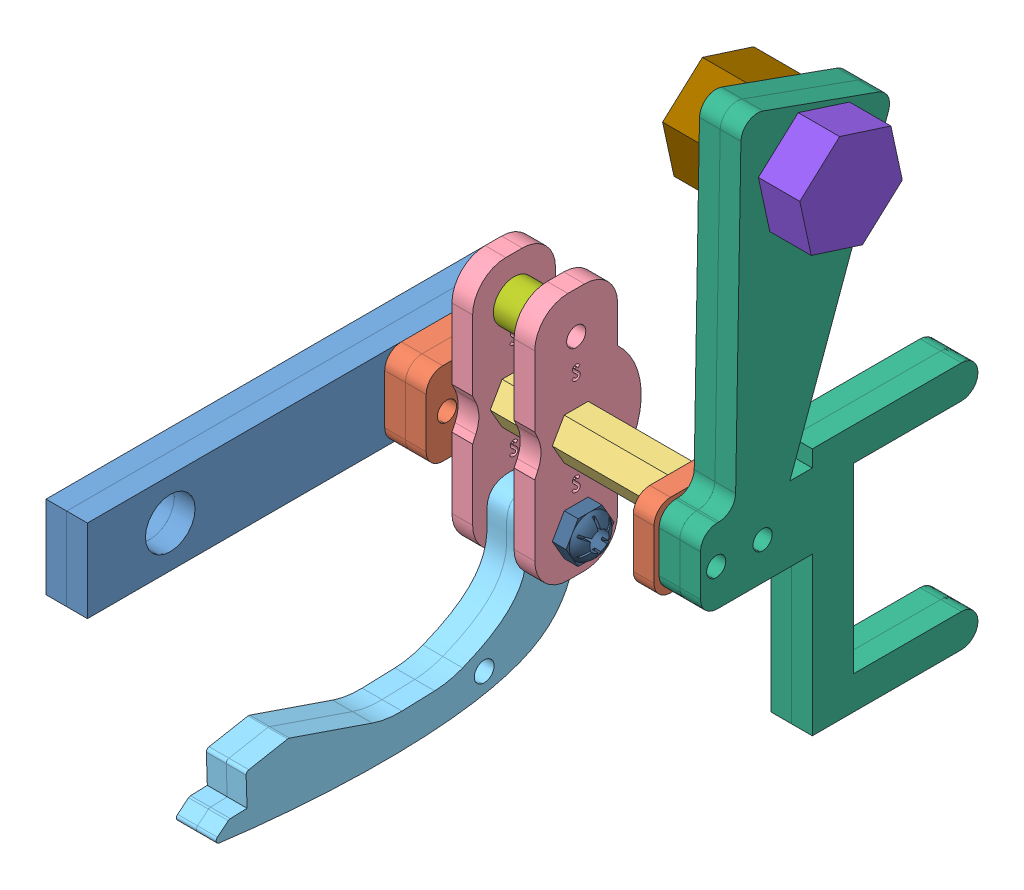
SolidWorks assembly Sautoir.SLDASM, configuration Default (file format 7000). Lengths in mm.
Overall size (60.33 90.66 88.9).
16 component instances, 10 part files, 32 mates.
Components (placement in the parent):
- SautoirMount-1: SautoirMount.SLDPRT [SautoirMountA] at (12.2439 19.1483 75.6794) size (3.17 12.7 68.58)
- SautoirMount-2: SautoirMount.SLDPRT [SautoirMountB] at (15.4189 19.1483 75.6794) size (3.17 12.7 68.58)
- SautoirMountC-1: SautoirMountC.SLDPRT [Default] at (18.5939 19.1483 30.1032) x (0 0 1) z (-1 0 0) size (21.39 21.71 3.17)
- SautoirMountC-2: SautoirMountC.SLDPRT [Default] at (21.7689 19.1483 30.1032) x (0 0 1) z (-1 0 0) size (21.39 21.71 3.17)
- Standoff-1p75in-1s4-1: Standoff-1p75in-1s4.SLDPRT [Default] at (59.8689 25.4983 19.7994) x (0 0.866025 0.5) z (0 -0.5 0.866025) size (7.33 44.45 6.35)
- SautoirArm-1: SautoirArm.SLDPRT [Default] at (24.9439 6.4483 26.1494) x (0 0 -1) z (1 0 0) size (16.31 38.1 3.17)
- SautoirArm-2: SautoirArm.SLDPRT [Default] at (34.4689 6.4483 26.1494) x (0 0 -1) z (1 0 0) size (16.31 38.1 3.17)
- CarryPawl-4: CarryPawl.SLDPRT [Default] at (28.1189 -15.4018 39.1312) x (0 0.033579 -0.999436) z (1 0 0) size (55.75 22.21 3.05)
- CarryPawl-3: CarryPawl.SLDPRT [Default] at (31.1669 -15.4018 39.1312) x (0 0.033579 -0.999436) z (1 0 0) size (55.75 22.21 3.05)
- CarryLever-2: CarryLever.SLDPRT [Default] at (59.8689 19.7833 26.1494) x (0 0 -1) z (1 0 0) size (42.55 86.89 3.17)
- CarryLever-3: CarryLever.SLDPRT [Default] at (63.0439 19.7833 26.1494) x (0 0 -1) z (1 0 0) size (42.55 86.89 3.17)
- SautoirMountC-3: SautoirMountC.SLDPRT [Default] at (56.6939 19.1483 30.1032) x (0 0 1) z (-1 0 0) size (21.39 21.71 3.17)
- Spacer-0p25-1s4-1: Spacer-0p25-1s4.SLDPRT [Default] at (28.1189 38.1983 19.7994) x (0 0 -1) z (1 0 0) size (6.35 6.35 6.35)
- Bolt-3s8-0p625-1: Bolt-3s8-0p625.SLDPRT [Default] at (66.2189 71.4105 12.5909) x (1 0 0) z (0 -0.672316 0.740264) size (22.23 14.29 16.5)
- Nut-3s8-1: Nut-3s8.SLDPRT [Default] at (51.5345 71.4105 12.5909) x (1 0 0) z (0 -0.672316 0.740264) size (8.33 14.29 16.5)
- Locknut-1: Locknut.SLDPRT [Default] at (39.7648 12.7983 19.7994) x (0 0 1) z (-1 0 0) size (7.33 6.35 3.56)
Mates (geometry in assembly coordinates):
- Coincident9: coincident aligned: line of SautoirMount-1 through (15.4189 31.8483 7.0994) axis (0 0 1); line of SautoirMount-2 through (15.4189 31.8483 7.0994) axis (0 0 1)
- Coincident10: coincident aligned: line of SautoirMount-1 through (15.4189 19.1483 7.0994) axis (0 1 0); line of SautoirMount-2 through (15.4189 19.1483 7.0994) axis (0 1 0)
- Coincident14: coincident anti-aligned: plane of Standoff-1p75in-1s4-1 through (15.4189 25.4983 19.7994) normal (-1 0 0); plane of SautoirMount-1 through (15.4189 19.1483 75.6794) normal (1 0 0)
- Coincident30: coincident anti-aligned: plane of CarryPawl-4 through (31.1669 3.7767 17.1335) normal (1 0 0); plane of CarryPawl-3 through (31.1669 3.7767 17.1335) normal (-1 0 0)
- Concentric6: concentric aligned: circle of CarryPawl-4; circle of CarryPawl-3
- Concentric7: concentric aligned: circle of CarryPawl-4; circle of CarryPawl-3
- Concentric11: concentric anti-aligned: circle of Bolt-3s8-0p625-1; circle of Nut-3s8-1
- Concentric12: concentric anti-aligned: circle of Standoff-1p75in-1s4-1; circle of CarryLever-2
- Coincident37: coincident aligned: circle of CarryLever-2; circle of CarryLever-3
- Concentric13: concentric anti-aligned: circle of CarryLever-3; circle of Bolt-3s8-0p625-1
- Coincident39: coincident anti-aligned: plane of CarryLever-3 through (66.2189 31.2133 -10.6806) normal (1 0 0); plane of Bolt-3s8-0p625-1 through (66.2189 71.4105 12.5909) normal (-1 0 0)
- Coincident40: coincident anti-aligned: plane of CarryLever-2 through (59.8689 31.2133 -10.6806) normal (-1 0 0); plane of Nut-3s8-1 through (59.8689 71.4105 12.5909) normal (1 0 0)
- Coincident44: coincident anti-aligned: plane of Standoff-1p75in-1s4-1 through (15.4189 28.6733 21.6325) normal (0 1 0); plane of SautoirMountC-1 through (21.7689 28.6733 17.9663) normal (0 -1 0)
- Coincident45: coincident aligned: circle of SautoirMount-2; circle of SautoirMountC-1
- Coincident46: coincident anti-aligned: plane of Standoff-1p75in-1s4-1 through (15.4189 28.6733 21.6325) normal (0 1 0); plane of SautoirMountC-2 through (24.9439 28.6733 17.9663) normal (0 -1 0)
- Coincident47: coincident aligned: circle of SautoirMountC-1; circle of SautoirMountC-2
- Coincident61: coincident anti-aligned: circle of SautoirArm-2; circle of Spacer-0p25-1s4-1
- Coincident62: coincident anti-aligned: circle of SautoirArm-1; circle of Spacer-0p25-1s4-1
- Coincident63: coincident anti-aligned: plane of Standoff-1p75in-1s4-1 through (15.4189 28.6733 21.6325) normal (0 1 0); plane of SautoirArm-1 through (28.1189 28.6733 17.9663) normal (0 -1 0)
- Coincident64: coincident anti-aligned: plane of Standoff-1p75in-1s4-1 through (15.4189 25.4983 23.4656) normal (0 0.5 0.866025); plane of SautoirArm-1 through (28.1189 28.6733 21.6325) normal (0 -0.5 -0.866025)
- Concentric16: concentric anti-aligned: circle of SautoirArm-1; circle of CarryPawl-4
- Coincident65: coincident anti-aligned: plane of SautoirArm-1 through (28.1189 6.4483 26.1494) normal (1 0 0); plane of CarryPawl-4 through (28.1189 3.7767 17.1335) normal (-1 0 0)
- Concentric17: concentric anti-aligned: circle of SautoirArm-2; circle of CarryPawl-3
- Coincident66: coincident anti-aligned: plane of SautoirArm-1 through (24.9439 6.4483 26.1494) normal (-1 0 0); plane of SautoirMountC-2 through (24.9439 19.1483 30.1032) normal (1 0 0)
- Coincident68: coincident aligned: circle of CarryLever-2; circle of SautoirMountC-3
- Parallel1: parallel aligned: plane of CarryLever-2 through (63.0439 19.7833 12.1794) normal (0 -1 0); plane of SautoirMountC-3 through (59.8689 19.1483 30.1032) normal (0 -1 0)
- Coincident70: coincident anti-aligned: plane of Standoff-1p75in-1s4-1 through (15.4189 28.6733 21.6325) normal (0 1 0); plane of SautoirMountC-3 through (59.8689 28.6733 17.9663) normal (0 -1 0)
- Coincident71: coincident anti-aligned: plane of Standoff-1p75in-1s4-1 through (59.8689 25.4983 19.7994) normal (1 0 0); plane of CarryLever-2 through (59.8689 31.2133 -10.6806) normal (-1 0 0)
- Coincident72: coincident aligned: circle of SautoirArm-2; circle of Locknut-1
- Coincident75: coincident aligned: circle of CarryLever-2; circle of CarryLever-3
- Coincident76: coincident aligned: line of SautoirMount-2 through (18.5939 28.6733 17.9663) axis (0 0 1); line of SautoirMountC-1 through (18.5939 28.6733 17.9663) axis (0 0 1)
- Concentric18: concentric anti-aligned: circle of SautoirMount-1; circle of Standoff-1p75in-1s4-1
